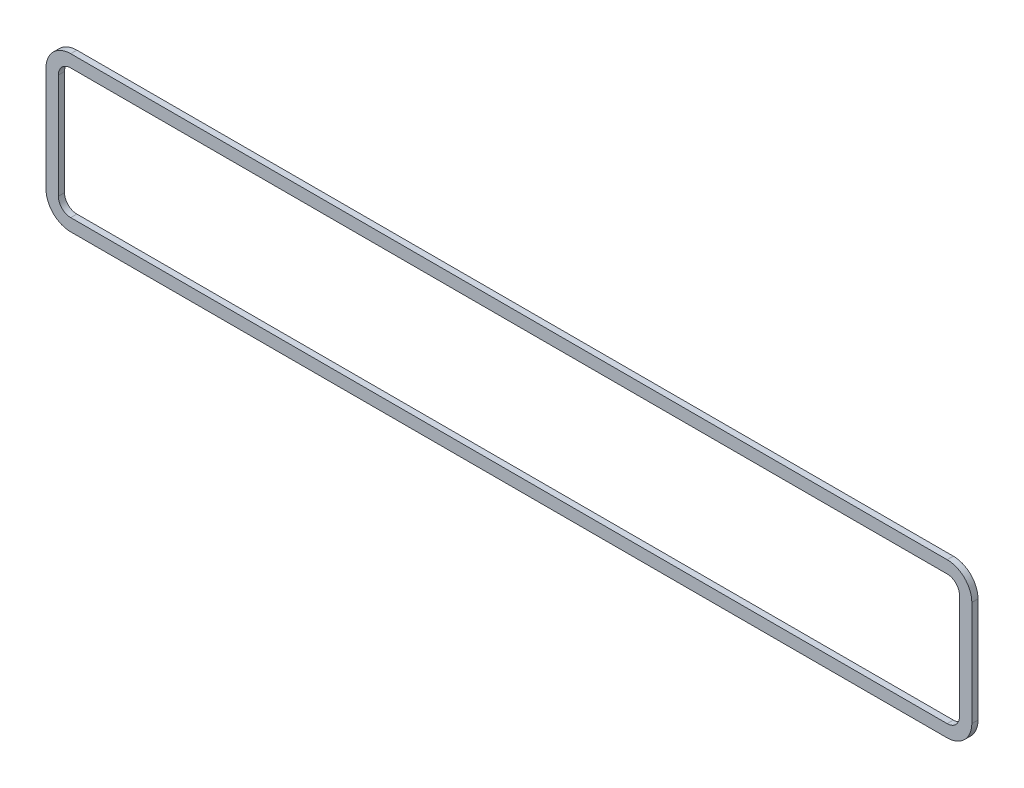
from build123d import *

# Parameters (mm, degrees)
LINEAR_AUSTRAGEN1_DEPTH = 0.5


with BuildPart() as part:
    # Skizze5 → Linear austragen1 (new body)
    with BuildSketch(Plane.XY):
        with BuildLine():
            Line((37.5, 0.5), (37.5, -8))
            ThreePointArc((37.5, -8), (36.914213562, -9.414213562), (35.5, -10))
            Line((35.5, -10), (-35.5, -10))
            ThreePointArc((-35.5, -10), (-36.914213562, -9.414213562), (-37.5, -8))
            Line((-37.5, -8), (-37.5, 0.5))
            ThreePointArc((-37.5, 0.5), (-36.914213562, 1.914213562), (-35.5, 2.5))
            Line((-35.5, 2.5), (35.5, 2.5))
            ThreePointArc((35.5, 2.5), (36.914213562, 1.914213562), (37.5, 0.5))
        make_face()
        with BuildLine():
            Line((-35.5, 1.5), (35.5, 1.5))
            ThreePointArc((35.5, 1.5), (36.207106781, 1.207106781), (36.5, 0.5))
            Line((36.5, 0.5), (36.5, -8))
            ThreePointArc((36.5, -8), (36.207106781, -8.707106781), (35.5, -9))
            Line((35.5, -9), (-35.5, -9))
            ThreePointArc((-35.5, -9), (-36.207106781, -8.707106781), (-36.5, -8))
            Line((-36.5, -8), (-36.5, 0.5))
            ThreePointArc((-36.5, 0.5), (-36.207106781, 1.207106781), (-35.5, 1.5))
        make_face(mode=Mode.SUBTRACT)
    extrude(amount=-LINEAR_AUSTRAGEN1_DEPTH)


solid = part.part
